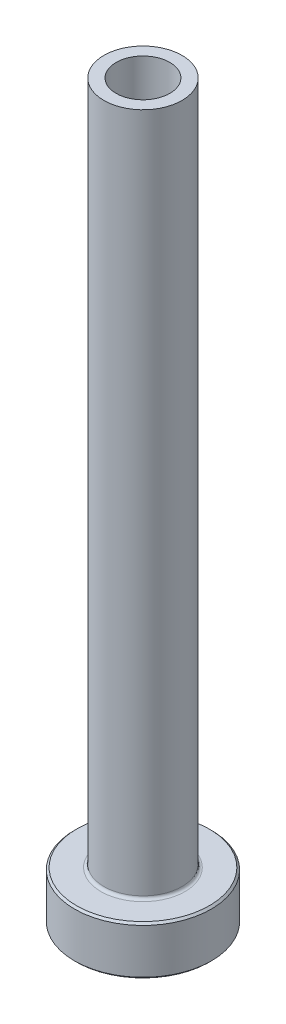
ISO-10303-21;
HEADER;
FILE_DESCRIPTION(('STEP AP214'),'2;1');
FILE_NAME('part.step','',(''),(''),'','','');
FILE_SCHEMA(('AUTOMOTIVE_DESIGN { 1 0 10303 214 1 1 1 1 }'));
ENDSEC;
DATA;
#1=APPLICATION_CONTEXT('core data for automotive mechanical design processes');
#2=APPLICATION_PROTOCOL_DEFINITION('international standard','automotive_design',2000,#1);
#3=PRODUCT_CONTEXT('',#1,'mechanical');
#4=PRODUCT('Part','Part','',(#3));
#5=PRODUCT_RELATED_PRODUCT_CATEGORY('part','',(#4));
#6=PRODUCT_DEFINITION_FORMATION('','',#4);
#7=PRODUCT_DEFINITION_CONTEXT('part definition',#1,'design');
#8=PRODUCT_DEFINITION('design','',#6,#7);
#9=PRODUCT_DEFINITION_SHAPE('','',#8);
#10=(LENGTH_UNIT() NAMED_UNIT(*) SI_UNIT(.MILLI.,.METRE.));
#11=(NAMED_UNIT(*) PLANE_ANGLE_UNIT() SI_UNIT($,.RADIAN.));
#12=(NAMED_UNIT(*) SI_UNIT($,.STERADIAN.) SOLID_ANGLE_UNIT());
#13=UNCERTAINTY_MEASURE_WITH_UNIT(LENGTH_MEASURE(1.E-05),#10,'distance_accuracy_value','');
#14=(GEOMETRIC_REPRESENTATION_CONTEXT(3) GLOBAL_UNCERTAINTY_ASSIGNED_CONTEXT((#13)) GLOBAL_UNIT_ASSIGNED_CONTEXT((#10,
#11,#12)) REPRESENTATION_CONTEXT('',''));
#15=CARTESIAN_POINT('',(0.,0.,0.));
#16=DIRECTION('',(0.,0.,1.));
#17=DIRECTION('',(1.,0.,0.));
#18=AXIS2_PLACEMENT_3D('',#15,#16,#17);
#19=CARTESIAN_POINT('',(0.,92.1876809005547,0.));
#20=DIRECTION('',(0.,1.,0.));
#21=DIRECTION('',(0.,0.,1.));
#22=AXIS2_PLACEMENT_3D('',#19,#20,#21);
#23=CYLINDRICAL_SURFACE('',#22,2.75000000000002);
#24=CARTESIAN_POINT('',(0.,75.,0.));
#25=DIRECTION('',(0.,1.,0.));
#26=DIRECTION('',(0.,0.,1.));
#27=AXIS2_PLACEMENT_3D('',#24,#25,#26);
#28=CIRCLE('',#27,2.75000000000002);
#29=CARTESIAN_POINT('',(0.,75.,2.75000000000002));
#30=VERTEX_POINT('',#29);
#31=EDGE_CURVE('E62',#30,#30,#28,.T.);
#32=ORIENTED_EDGE('',*,*,#31,.T.);
#33=EDGE_LOOP('',(#32));
#34=FACE_BOUND('',#33,.T.);
#35=CARTESIAN_POINT('',(0.,30.,0.));
#36=DIRECTION('',(0.,1.,0.));
#37=DIRECTION('',(0.,0.,1.));
#38=AXIS2_PLACEMENT_3D('',#35,#36,#37);
#39=CIRCLE('',#38,2.75000000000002);
#40=CARTESIAN_POINT('',(0.,30.,2.75000000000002));
#41=VERTEX_POINT('',#40);
#42=EDGE_CURVE('E71',#41,#41,#39,.T.);
#43=ORIENTED_EDGE('',*,*,#42,.F.);
#44=EDGE_LOOP('',(#43));
#45=FACE_BOUND('',#44,.T.);
#46=ADVANCED_FACE('F30',(#34,#45),#23,.F.);
#47=CARTESIAN_POINT('',(-2.75000000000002,75.,0.));
#48=DIRECTION('',(0.,1.,0.));
#49=DIRECTION('',(0.,0.,1.));
#50=AXIS2_PLACEMENT_3D('',#47,#48,#49);
#51=PLANE('',#50);
#52=CARTESIAN_POINT('',(0.,75.,0.));
#53=DIRECTION('',(0.,1.,0.));
#54=DIRECTION('',(0.,0.,1.));
#55=AXIS2_PLACEMENT_3D('',#52,#53,#54);
#56=CIRCLE('',#55,4.);
#57=CARTESIAN_POINT('',(0.,75.,4.));
#58=VERTEX_POINT('',#57);
#59=EDGE_CURVE('E65',#58,#58,#56,.T.);
#60=ORIENTED_EDGE('',*,*,#59,.T.);
#61=EDGE_LOOP('',(#60));
#62=FACE_BOUND('',#61,.T.);
#63=ORIENTED_EDGE('',*,*,#31,.F.);
#64=EDGE_LOOP('',(#63));
#65=FACE_BOUND('',#64,.T.);
#66=ADVANCED_FACE('F79',(#62,#65),#51,.T.);
#67=CARTESIAN_POINT('',(0.,92.1876809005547,0.));
#68=DIRECTION('',(0.,1.,0.));
#69=DIRECTION('',(0.,0.,1.));
#70=AXIS2_PLACEMENT_3D('',#67,#68,#69);
#71=CYLINDRICAL_SURFACE('',#70,3.99999999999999);
#72=CARTESIAN_POINT('',(0.,5.3,0.));
#73=DIRECTION('',(0.,1.,0.));
#74=DIRECTION('',(0.,0.,1.));
#75=AXIS2_PLACEMENT_3D('',#72,#73,#74);
#76=CIRCLE('',#75,3.99999999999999);
#77=CARTESIAN_POINT('',(0.,5.3,3.99999999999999));
#78=VERTEX_POINT('',#77);
#79=EDGE_CURVE('E59',#78,#78,#76,.T.);
#80=ORIENTED_EDGE('',*,*,#79,.T.);
#81=EDGE_LOOP('',(#80));
#82=FACE_BOUND('',#81,.T.);
#83=ORIENTED_EDGE('',*,*,#59,.F.);
#84=EDGE_LOOP('',(#83));
#85=FACE_BOUND('',#84,.T.);
#86=ADVANCED_FACE('F85',(#82,#85),#71,.T.);
#87=CARTESIAN_POINT('',(-3.99999999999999,5.,0.));
#88=DIRECTION('',(0.,1.,0.));
#89=DIRECTION('',(0.,0.,1.));
#90=AXIS2_PLACEMENT_3D('',#87,#88,#89);
#91=PLANE('',#90);
#92=CARTESIAN_POINT('',(0.,5.,0.));
#93=DIRECTION('',(0.,1.,0.));
#94=DIRECTION('',(0.,0.,1.));
#95=AXIS2_PLACEMENT_3D('',#92,#93,#94);
#96=CIRCLE('',#95,6.8);
#97=CARTESIAN_POINT('',(0.,5.,6.8));
#98=VERTEX_POINT('',#97);
#99=EDGE_CURVE('E53',#98,#98,#96,.T.);
#100=ORIENTED_EDGE('',*,*,#99,.T.);
#101=EDGE_LOOP('',(#100));
#102=FACE_BOUND('',#101,.T.);
#103=CARTESIAN_POINT('',(0.,5.,0.));
#104=DIRECTION('',(0.,1.,0.));
#105=DIRECTION('',(0.,0.,1.));
#106=AXIS2_PLACEMENT_3D('',#103,#104,#105);
#107=CIRCLE('',#106,4.29999999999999);
#108=CARTESIAN_POINT('',(0.,5.,4.29999999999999));
#109=VERTEX_POINT('',#108);
#110=EDGE_CURVE('E56',#109,#109,#107,.F.);
#111=ORIENTED_EDGE('',*,*,#110,.T.);
#112=EDGE_LOOP('',(#111));
#113=FACE_BOUND('',#112,.T.);
#114=ADVANCED_FACE('F111',(#102,#113),#91,.T.);
#115=CARTESIAN_POINT('',(0.,92.1876809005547,0.));
#116=DIRECTION('',(0.,1.,0.));
#117=DIRECTION('',(0.,0.,1.));
#118=AXIS2_PLACEMENT_3D('',#115,#116,#117);
#119=CYLINDRICAL_SURFACE('',#118,6.99999999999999);
#120=CARTESIAN_POINT('',(0.,4.8,0.));
#121=DIRECTION('',(0.,1.,0.));
#122=DIRECTION('',(0.,0.,1.));
#123=AXIS2_PLACEMENT_3D('',#120,#121,#122);
#124=CIRCLE('',#123,6.99999999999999);
#125=CARTESIAN_POINT('',(0.,4.8,6.99999999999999));
#126=VERTEX_POINT('',#125);
#127=EDGE_CURVE('E45',#126,#126,#124,.F.);
#128=ORIENTED_EDGE('',*,*,#127,.T.);
#129=EDGE_LOOP('',(#128));
#130=FACE_BOUND('',#129,.T.);
#131=CARTESIAN_POINT('',(0.,0.199999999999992,0.));
#132=DIRECTION('',(0.,-1.,0.));
#133=DIRECTION('',(0.,0.,-1.));
#134=AXIS2_PLACEMENT_3D('',#131,#132,#133);
#135=CIRCLE('',#134,6.99999999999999);
#136=CARTESIAN_POINT('',(0.,0.199999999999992,-6.99999999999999));
#137=VERTEX_POINT('',#136);
#138=EDGE_CURVE('E50',#137,#137,#135,.F.);
#139=ORIENTED_EDGE('',*,*,#138,.T.);
#140=EDGE_LOOP('',(#139));
#141=FACE_BOUND('',#140,.T.);
#142=ADVANCED_FACE('F108',(#130,#141),#119,.T.);
#143=CARTESIAN_POINT('',(-6.99999999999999,0.,0.));
#144=DIRECTION('',(0.,-1.,0.));
#145=DIRECTION('',(0.,0.,-1.));
#146=AXIS2_PLACEMENT_3D('',#143,#144,#145);
#147=PLANE('',#146);
#148=CARTESIAN_POINT('',(0.,0.,0.));
#149=DIRECTION('',(0.,-1.,0.));
#150=DIRECTION('',(0.,0.,-1.));
#151=AXIS2_PLACEMENT_3D('',#148,#149,#150);
#152=CIRCLE('',#151,3.49999999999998);
#153=CARTESIAN_POINT('',(0.,0.,-3.49999999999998));
#154=VERTEX_POINT('',#153);
#155=EDGE_CURVE('E37',#154,#154,#152,.F.);
#156=ORIENTED_EDGE('',*,*,#155,.T.);
#157=EDGE_LOOP('',(#156));
#158=FACE_BOUND('',#157,.T.);
#159=CARTESIAN_POINT('',(0.,0.,0.));
#160=DIRECTION('',(0.,-1.,0.));
#161=DIRECTION('',(0.,0.,-1.));
#162=AXIS2_PLACEMENT_3D('',#159,#160,#161);
#163=CIRCLE('',#162,6.80000000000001);
#164=CARTESIAN_POINT('',(0.,0.,-6.80000000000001));
#165=VERTEX_POINT('',#164);
#166=EDGE_CURVE('E41',#165,#165,#163,.T.);
#167=ORIENTED_EDGE('',*,*,#166,.T.);
#168=EDGE_LOOP('',(#167));
#169=FACE_BOUND('',#168,.T.);
#170=ADVANCED_FACE('F110',(#158,#169),#147,.T.);
#171=CARTESIAN_POINT('',(0.,92.1876809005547,0.));
#172=DIRECTION('',(0.,1.,0.));
#173=DIRECTION('',(0.,0.,1.));
#174=AXIS2_PLACEMENT_3D('',#171,#172,#173);
#175=CYLINDRICAL_SURFACE('',#174,2.99999999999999);
#176=CARTESIAN_POINT('',(0.,0.499999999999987,0.));
#177=DIRECTION('',(0.,-1.,0.));
#178=DIRECTION('',(0.,0.,-1.));
#179=AXIS2_PLACEMENT_3D('',#176,#177,#178);
#180=CIRCLE('',#179,2.99999999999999);
#181=CARTESIAN_POINT('',(0.,0.499999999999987,-2.99999999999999));
#182=VERTEX_POINT('',#181);
#183=EDGE_CURVE('E10',#182,#182,#180,.T.);
#184=ORIENTED_EDGE('',*,*,#183,.T.);
#185=EDGE_LOOP('',(#184));
#186=FACE_BOUND('',#185,.T.);
#187=CARTESIAN_POINT('',(0.,18.,0.));
#188=DIRECTION('',(0.,1.,0.));
#189=DIRECTION('',(0.,0.,1.));
#190=AXIS2_PLACEMENT_3D('',#187,#188,#189);
#191=CIRCLE('',#190,2.99999999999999);
#192=CARTESIAN_POINT('',(0.,18.,2.99999999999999));
#193=VERTEX_POINT('',#192);
#194=EDGE_CURVE('E68',#193,#193,#191,.T.);
#195=ORIENTED_EDGE('',*,*,#194,.T.);
#196=EDGE_LOOP('',(#195));
#197=FACE_BOUND('',#196,.T.);
#198=ADVANCED_FACE('F118',(#186,#197),#175,.F.);
#199=CARTESIAN_POINT('',(0.,18.,0.));
#200=DIRECTION('',(0.,-1.,0.));
#201=DIRECTION('',(0.,0.,-1.));
#202=AXIS2_PLACEMENT_3D('',#199,#200,#201);
#203=CONICAL_SURFACE('',#202,2.99999999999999,0.0208303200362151);
#204=ORIENTED_EDGE('',*,*,#42,.T.);
#205=EDGE_LOOP('',(#204));
#206=FACE_BOUND('',#205,.T.);
#207=ORIENTED_EDGE('',*,*,#194,.F.);
#208=EDGE_LOOP('',(#207));
#209=FACE_BOUND('',#208,.T.);
#210=ADVANCED_FACE('F75',(#206,#209),#203,.F.);
#211=CARTESIAN_POINT('',(0.,5.3,0.));
#212=DIRECTION('',(0.,1.,0.));
#213=DIRECTION('',(0.,0.,1.));
#214=AXIS2_PLACEMENT_3D('',#211,#212,#213);
#215=TOROIDAL_SURFACE('',#214,4.29999999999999,0.3);
#216=ORIENTED_EDGE('',*,*,#110,.F.);
#217=EDGE_LOOP('',(#216));
#218=FACE_BOUND('',#217,.T.);
#219=ORIENTED_EDGE('',*,*,#79,.F.);
#220=EDGE_LOOP('',(#219));
#221=FACE_BOUND('',#220,.T.);
#222=ADVANCED_FACE('F90',(#218,#221),#215,.F.);
#223=CARTESIAN_POINT('',(0.,5.,0.));
#224=DIRECTION('',(0.,-1.,0.));
#225=DIRECTION('',(0.,0.,-1.));
#226=AXIS2_PLACEMENT_3D('',#223,#224,#225);
#227=CONICAL_SURFACE('',#226,6.79999999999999,0.785398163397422);
#228=ORIENTED_EDGE('',*,*,#127,.F.);
#229=EDGE_LOOP('',(#228));
#230=FACE_BOUND('',#229,.T.);
#231=ORIENTED_EDGE('',*,*,#99,.F.);
#232=EDGE_LOOP('',(#231));
#233=FACE_BOUND('',#232,.T.);
#234=ADVANCED_FACE('F93',(#230,#233),#227,.T.);
#235=CARTESIAN_POINT('',(0.,0.199999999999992,0.));
#236=DIRECTION('',(0.,1.,0.));
#237=DIRECTION('',(0.,0.,1.));
#238=AXIS2_PLACEMENT_3D('',#235,#236,#237);
#239=CONICAL_SURFACE('',#238,6.99999999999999,0.785398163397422);
#240=ORIENTED_EDGE('',*,*,#166,.F.);
#241=EDGE_LOOP('',(#240));
#242=FACE_BOUND('',#241,.T.);
#243=ORIENTED_EDGE('',*,*,#138,.F.);
#244=EDGE_LOOP('',(#243));
#245=FACE_BOUND('',#244,.T.);
#246=ADVANCED_FACE('F96',(#242,#245),#239,.T.);
#247=CARTESIAN_POINT('',(0.,0.,0.));
#248=DIRECTION('',(0.,-1.,0.));
#249=DIRECTION('',(0.,0.,-1.));
#250=AXIS2_PLACEMENT_3D('',#247,#248,#249);
#251=CONICAL_SURFACE('',#250,3.49999999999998,0.785398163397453);
#252=ORIENTED_EDGE('',*,*,#183,.F.);
#253=EDGE_LOOP('',(#252));
#254=FACE_BOUND('',#253,.T.);
#255=ORIENTED_EDGE('',*,*,#155,.F.);
#256=EDGE_LOOP('',(#255));
#257=FACE_BOUND('',#256,.T.);
#258=ADVANCED_FACE('F32',(#254,#257),#251,.F.);
#259=CLOSED_SHELL('',(#46,#66,#86,#114,#142,#170,#198,#210,#222,#234,#246,#258));
#260=MANIFOLD_SOLID_BREP('B2',#259);
#261=ADVANCED_BREP_SHAPE_REPRESENTATION('',(#18,#260),#14);
#262=SHAPE_DEFINITION_REPRESENTATION(#9,#261);
ENDSEC;
END-ISO-10303-21;
